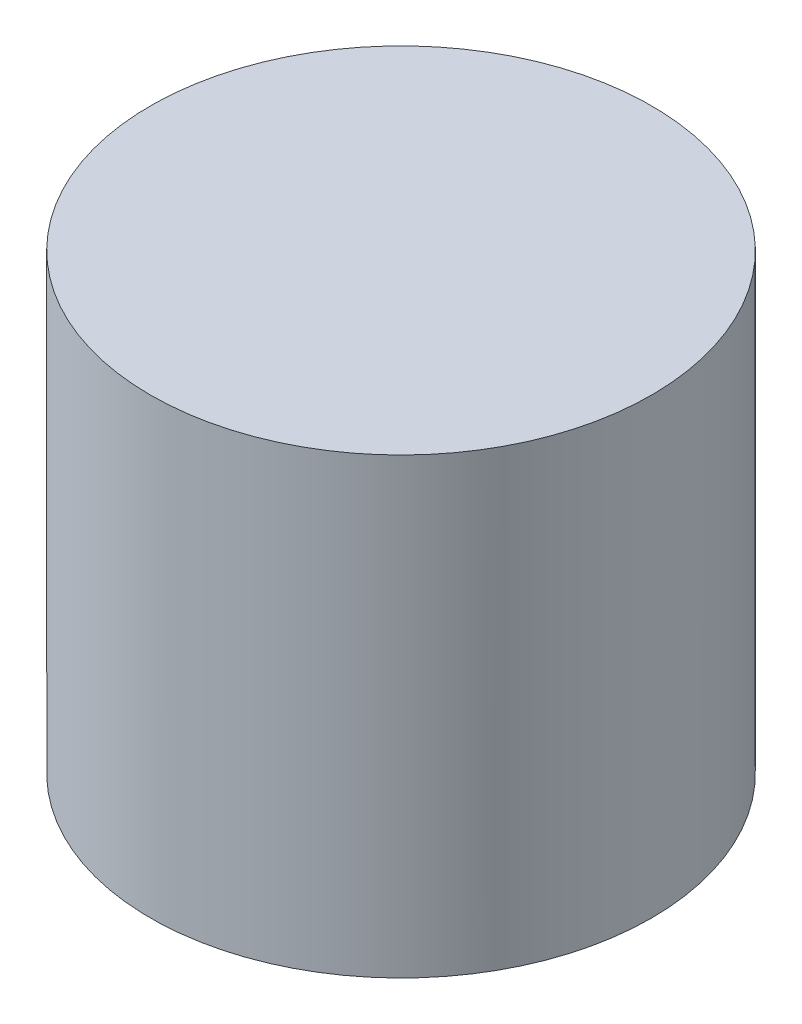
from build123d import *

# Parameters (mm, degrees)
SKETCH1_R                 = 31.75
EXTRUDE1_DEPTH            = 57.4
CIRPATTERN1_COUNT         = 3
SKETCH3_W                 = 38.323662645
SKETCH3_H                 = 21.59
CUT_EXTRUDE1_DEPTH        = 89.860033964
M5X0_8_TAPPED_HOLE1_D     = 4.2
M5X0_8_TAPPED_HOLE1_DEPTH = 8.382
M5X0_8_TAPPED_HOLE1_TIP   = 1.2618073
HOLE1_D                   = 5
HOLE1_DEPTH               = 8
HOLE1_TIP                 = 1.502151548


with BuildPart() as part:
    # Sketch1 → Extrude1 (new body)
    with BuildSketch(Plane(origin=(0, 0, 0), x_dir=(1, 0, 0), z_dir=(0, 1, 0))):
        with Locations(Location((0, 0, 0), (0, 0, 270))):
            Circle(SKETCH1_R)
    extrude(amount=EXTRUDE1_DEPTH)

    # Sketch2 → M6x1.0 Tapped Hole1 (revolve, cut)
    with BuildSketch(Plane(origin=(0, 0, -17.5), x_dir=(0, 0, -1), z_dir=(1, 0, 0))):
        Polygon((0, 0), (0, 14.202151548), (2.5, 12.7), (2.5, 0), align=None)
    m6x1_0_tapped_hole1 = revolve(axis=Axis((0, -6.35, -17.5), (0, 1, 0)), mode=Mode.SUBTRACT)

    # CirPattern1: M6x1.0 Tapped Hole1 ×3 about axis
    cirpattern1_axis = Axis((0, 0, 0), (0, 1, 0))
    for i in range(1, CIRPATTERN1_COUNT):
        add(m6x1_0_tapped_hole1.rotate(cirpattern1_axis, i * 360 / CIRPATTERN1_COUNT), mode=Mode.SUBTRACT)

    # Sketch3 → Cut-Extrude1 (cut, through all)
    with BuildSketch(Plane.XY.offset(-28.194)):
        with Locations((1.091220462, 10.795)):
            Rectangle(SKETCH3_W, SKETCH3_H)
    extrude(amount=-CUT_EXTRUDE1_DEPTH, mode=Mode.SUBTRACT)

    # M5x0.8 Tapped Hole1
    with Locations(Plane(origin=(-8.89, 7.62, -28.194), x_dir=(-1, 0, 0), z_dir=(0, 0, -1))):
        with Locations((0, 0), (-17.78, 0), (-8.89, 6.985)):
            Hole(M5X0_8_TAPPED_HOLE1_D / 2, depth=M5X0_8_TAPPED_HOLE1_DEPTH)
            with Locations((0, 0, -(M5X0_8_TAPPED_HOLE1_DEPTH + M5X0_8_TAPPED_HOLE1_TIP / 2))):  # 118° drill point
                Cone(0, M5X0_8_TAPPED_HOLE1_D / 2, M5X0_8_TAPPED_HOLE1_TIP, mode=Mode.SUBTRACT)

    # Hole1
    with Locations(Plane.XZ):
        with Locations((-17.5, 0), (17.5, 0)):
            Hole(HOLE1_D / 2, depth=HOLE1_DEPTH)
            with Locations((0, 0, -(HOLE1_DEPTH + HOLE1_TIP / 2))):  # 118° drill point
                Cone(0, HOLE1_D / 2, HOLE1_TIP, mode=Mode.SUBTRACT)


solid = part.part
